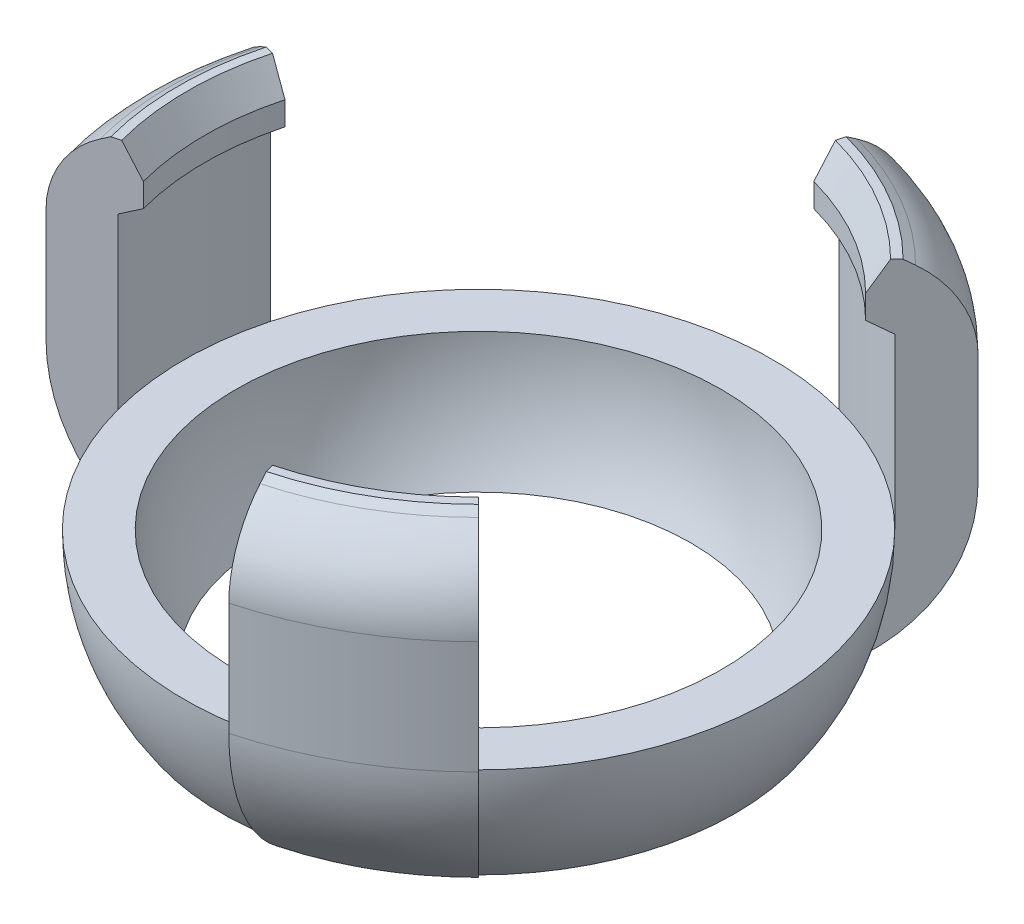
ISO-10303-21;
HEADER;
FILE_DESCRIPTION(('STEP AP214'),'2;1');
FILE_NAME('part.step','',(''),(''),'','','');
FILE_SCHEMA(('AUTOMOTIVE_DESIGN { 1 0 10303 214 1 1 1 1 }'));
ENDSEC;
DATA;
#1=APPLICATION_CONTEXT('core data for automotive mechanical design processes');
#2=APPLICATION_PROTOCOL_DEFINITION('international standard','automotive_design',2000,#1);
#3=PRODUCT_CONTEXT('',#1,'mechanical');
#4=PRODUCT('Part','Part','',(#3));
#5=PRODUCT_RELATED_PRODUCT_CATEGORY('part','',(#4));
#6=PRODUCT_DEFINITION_FORMATION('','',#4);
#7=PRODUCT_DEFINITION_CONTEXT('part definition',#1,'design');
#8=PRODUCT_DEFINITION('design','',#6,#7);
#9=PRODUCT_DEFINITION_SHAPE('','',#8);
#10=(LENGTH_UNIT() NAMED_UNIT(*) SI_UNIT(.MILLI.,.METRE.));
#11=(NAMED_UNIT(*) PLANE_ANGLE_UNIT() SI_UNIT($,.RADIAN.));
#12=(NAMED_UNIT(*) SI_UNIT($,.STERADIAN.) SOLID_ANGLE_UNIT());
#13=UNCERTAINTY_MEASURE_WITH_UNIT(LENGTH_MEASURE(1.E-05),#10,'distance_accuracy_value','');
#14=(GEOMETRIC_REPRESENTATION_CONTEXT(3) GLOBAL_UNCERTAINTY_ASSIGNED_CONTEXT((#13)) GLOBAL_UNIT_ASSIGNED_CONTEXT((#10,
#11,#12)) REPRESENTATION_CONTEXT('',''));
#15=CARTESIAN_POINT('',(0.,0.,0.));
#16=DIRECTION('',(0.,0.,1.));
#17=DIRECTION('',(1.,0.,0.));
#18=AXIS2_PLACEMENT_3D('',#15,#16,#17);
#19=CARTESIAN_POINT('',(0.,0.,0.));
#20=DIRECTION('',(0.,-1.,0.));
#21=DIRECTION('',(0.,0.,-1.));
#22=AXIS2_PLACEMENT_3D('',#19,#20,#21);
#23=CYLINDRICAL_SURFACE('',#22,10.);
#24=CARTESIAN_POINT('',(0.,5.75,0.));
#25=DIRECTION('',(0.,-1.,0.));
#26=DIRECTION('',(0.,0.,-1.));
#27=AXIS2_PLACEMENT_3D('',#24,#25,#26);
#28=CIRCLE('',#27,10.);
#29=CARTESIAN_POINT('',(2.58819045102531,5.75,-9.65925826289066));
#30=VERTEX_POINT('',#29);
#31=CARTESIAN_POINT('',(7.07106781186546,5.75,-7.07106781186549));
#32=VERTEX_POINT('',#31);
#33=EDGE_CURVE('E262',#30,#32,#28,.T.);
#34=ORIENTED_EDGE('',*,*,#33,.F.);
#35=DIRECTION('',(0.,-1.,0.));
#36=VECTOR('',#35,1.);
#37=CARTESIAN_POINT('',(2.58819045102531,0.,-9.65925826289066));
#38=LINE('',#37,#36);
#39=CARTESIAN_POINT('',(2.58819045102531,0.,-9.65925826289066));
#40=VERTEX_POINT('',#39);
#41=EDGE_CURVE('E250',#30,#40,#38,.T.);
#42=ORIENTED_EDGE('',*,*,#41,.T.);
#43=CARTESIAN_POINT('',(0.,0.,0.));
#44=DIRECTION('',(0.,-1.,0.));
#45=DIRECTION('',(0.,0.,-1.));
#46=AXIS2_PLACEMENT_3D('',#43,#44,#45);
#47=CIRCLE('',#46,10.);
#48=CARTESIAN_POINT('',(7.07106781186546,0.,-7.07106781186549));
#49=VERTEX_POINT('',#48);
#50=EDGE_CURVE('E260',#40,#49,#47,.T.);
#51=ORIENTED_EDGE('',*,*,#50,.T.);
#52=DIRECTION('',(0.,-1.,0.));
#53=VECTOR('',#52,1.);
#54=CARTESIAN_POINT('',(7.07106781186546,0.,-7.07106781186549));
#55=LINE('',#54,#53);
#56=EDGE_CURVE('E442',#32,#49,#55,.T.);
#57=ORIENTED_EDGE('',*,*,#56,.F.);
#58=EDGE_LOOP('',(#34,#42,#51,#57));
#59=FACE_BOUND('',#58,.T.);
#60=ADVANCED_FACE('F39',(#59),#23,.F.);
#61=CARTESIAN_POINT('',(0.,6.15414518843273,0.));
#62=DIRECTION('',(0.,-1.,0.));
#63=DIRECTION('',(0.,0.,-1.));
#64=AXIS2_PLACEMENT_3D('',#61,#62,#63);
#65=CONICAL_SURFACE('',#64,9.3,1.0471975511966);
#66=CARTESIAN_POINT('',(0.,6.15414518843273,0.));
#67=DIRECTION('',(0.,-1.,0.));
#68=DIRECTION('',(0.,0.,-1.));
#69=AXIS2_PLACEMENT_3D('',#66,#67,#68);
#70=CIRCLE('',#69,9.3);
#71=CARTESIAN_POINT('',(2.40701711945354,6.15414518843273,-8.98311018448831));
#72=VERTEX_POINT('',#71);
#73=CARTESIAN_POINT('',(6.57609306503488,6.15414518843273,-6.5760930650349));
#74=VERTEX_POINT('',#73);
#75=EDGE_CURVE('E490',#72,#74,#70,.T.);
#76=ORIENTED_EDGE('',*,*,#75,.F.);
#77=DIRECTION('',(0.224143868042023,-0.499999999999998,-0.836516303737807));
#78=VECTOR('',#77,1.);
#79=CARTESIAN_POINT('',(0.,11.5235026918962,0.));
#80=LINE('',#79,#78);
#81=EDGE_CURVE('E265',#72,#30,#80,.T.);
#82=ORIENTED_EDGE('',*,*,#81,.T.);
#83=ORIENTED_EDGE('',*,*,#33,.T.);
#84=DIRECTION('',(0.612372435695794,-0.499999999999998,-0.612372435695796));
#85=VECTOR('',#84,1.);
#86=CARTESIAN_POINT('',(0.,11.5235026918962,0.));
#87=LINE('',#86,#85);
#88=EDGE_CURVE('E438',#74,#32,#87,.T.);
#89=ORIENTED_EDGE('',*,*,#88,.F.);
#90=EDGE_LOOP('',(#76,#82,#83,#89));
#91=FACE_BOUND('',#90,.T.);
#92=ADVANCED_FACE('F515',(#91),#65,.F.);
#93=CARTESIAN_POINT('',(0.,0.,0.));
#94=DIRECTION('',(0.,-1.,0.));
#95=DIRECTION('',(0.,0.,-1.));
#96=AXIS2_PLACEMENT_3D('',#93,#94,#95);
#97=CYLINDRICAL_SURFACE('',#96,9.3);
#98=CARTESIAN_POINT('',(0.,6.95414518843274,0.));
#99=DIRECTION('',(0.,-1.,0.));
#100=DIRECTION('',(0.,0.,-1.));
#101=AXIS2_PLACEMENT_3D('',#98,#99,#100);
#102=CIRCLE('',#101,9.3);
#103=CARTESIAN_POINT('',(2.40701711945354,6.95414518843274,-8.98311018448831));
#104=VERTEX_POINT('',#103);
#105=CARTESIAN_POINT('',(6.57609306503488,6.95414518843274,-6.5760930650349));
#106=VERTEX_POINT('',#105);
#107=EDGE_CURVE('E484',#104,#106,#102,.T.);
#108=ORIENTED_EDGE('',*,*,#107,.F.);
#109=DIRECTION('',(0.,-1.,0.));
#110=VECTOR('',#109,1.);
#111=CARTESIAN_POINT('',(2.40701711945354,0.,-8.98311018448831));
#112=LINE('',#111,#110);
#113=EDGE_CURVE('E509',#104,#72,#112,.T.);
#114=ORIENTED_EDGE('',*,*,#113,.T.);
#115=ORIENTED_EDGE('',*,*,#75,.T.);
#116=DIRECTION('',(0.,-1.,0.));
#117=VECTOR('',#116,1.);
#118=CARTESIAN_POINT('',(6.57609306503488,0.,-6.5760930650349));
#119=LINE('',#118,#117);
#120=EDGE_CURVE('E434',#106,#74,#119,.T.);
#121=ORIENTED_EDGE('',*,*,#120,.F.);
#122=EDGE_LOOP('',(#108,#114,#115,#121));
#123=FACE_BOUND('',#122,.T.);
#124=ADVANCED_FACE('F508',(#123),#97,.F.);
#125=CARTESIAN_POINT('',(0.,7.95414518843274,0.));
#126=DIRECTION('',(0.,1.,0.));
#127=DIRECTION('',(0.,0.,1.));
#128=AXIS2_PLACEMENT_3D('',#125,#126,#127);
#129=CONICAL_SURFACE('',#128,9.9,0.540419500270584);
#130=CARTESIAN_POINT('',(0.,7.95414518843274,0.));
#131=DIRECTION('',(0.,-1.,0.));
#132=DIRECTION('',(0.,0.,-1.));
#133=AXIS2_PLACEMENT_3D('',#130,#131,#132);
#134=CIRCLE('',#133,9.9);
#135=CARTESIAN_POINT('',(2.56230854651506,7.95414518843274,-9.56266568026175));
#136=VERTEX_POINT('',#135);
#137=CARTESIAN_POINT('',(7.00035713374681,7.95414518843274,-7.00035713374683));
#138=VERTEX_POINT('',#137);
#139=EDGE_CURVE('E478',#136,#138,#134,.T.);
#140=ORIENTED_EDGE('',*,*,#139,.F.);
#141=DIRECTION('',(-0.133161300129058,-0.857492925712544,0.49696473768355));
#142=VECTOR('',#141,1.);
#143=CARTESIAN_POINT('',(0.,-8.54585481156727,0.));
#144=LINE('',#143,#142);
#145=EDGE_CURVE('E519',#136,#104,#144,.T.);
#146=ORIENTED_EDGE('',*,*,#145,.T.);
#147=ORIENTED_EDGE('',*,*,#107,.T.);
#148=DIRECTION('',(-0.363803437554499,-0.857492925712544,0.3638034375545));
#149=VECTOR('',#148,1.);
#150=CARTESIAN_POINT('',(0.,-8.54585481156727,0.));
#151=LINE('',#150,#149);
#152=EDGE_CURVE('E430',#138,#106,#151,.T.);
#153=ORIENTED_EDGE('',*,*,#152,.F.);
#154=EDGE_LOOP('',(#140,#146,#147,#153));
#155=FACE_BOUND('',#154,.T.);
#156=ADVANCED_FACE('F576',(#155),#129,.F.);
#157=CARTESIAN_POINT('',(9.9,7.95414518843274,0.));
#158=DIRECTION('',(0.,1.,0.));
#159=DIRECTION('',(0.,0.,1.));
#160=AXIS2_PLACEMENT_3D('',#157,#158,#159);
#161=PLANE('',#160);
#162=CARTESIAN_POINT('',(0.,7.95414518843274,0.));
#163=DIRECTION('',(0.,-1.,0.));
#164=DIRECTION('',(0.,0.,-1.));
#165=AXIS2_PLACEMENT_3D('',#162,#163,#164);
#166=CIRCLE('',#165,10.2);
#167=CARTESIAN_POINT('',(2.63995426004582,7.95414518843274,-9.85244342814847));
#168=VERTEX_POINT('',#167);
#169=CARTESIAN_POINT('',(7.21248916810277,7.95414518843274,-7.2124891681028));
#170=VERTEX_POINT('',#169);
#171=EDGE_CURVE('E472',#168,#170,#166,.T.);
#172=ORIENTED_EDGE('',*,*,#171,.F.);
#173=DIRECTION('',(-0.258819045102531,0.,0.965925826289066));
#174=VECTOR('',#173,1.);
#175=CARTESIAN_POINT('',(0.663174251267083,7.95414518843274,-2.47500000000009));
#176=LINE('',#175,#174);
#177=EDGE_CURVE('E579',#168,#136,#176,.T.);
#178=ORIENTED_EDGE('',*,*,#177,.T.);
#179=ORIENTED_EDGE('',*,*,#139,.T.);
#180=DIRECTION('',(-0.707106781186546,0.,0.707106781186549));
#181=VECTOR('',#180,1.);
#182=CARTESIAN_POINT('',(4.94999999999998,7.95414518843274,-4.95));
#183=LINE('',#182,#181);
#184=EDGE_CURVE('E426',#170,#138,#183,.T.);
#185=ORIENTED_EDGE('',*,*,#184,.F.);
#186=EDGE_LOOP('',(#172,#178,#179,#185));
#187=FACE_BOUND('',#186,.T.);
#188=ADVANCED_FACE('F697',(#187),#161,.T.);
#189=CARTESIAN_POINT('',(0.,7.78094010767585,0.));
#190=DIRECTION('',(0.,-1.,0.));
#191=DIRECTION('',(0.,0.,-1.));
#192=AXIS2_PLACEMENT_3D('',#189,#190,#191);
#193=CONICAL_SURFACE('',#192,10.5,1.04719755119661);
#194=CARTESIAN_POINT('',(0.,7.78094010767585,0.));
#195=DIRECTION('',(0.,-1.,0.));
#196=DIRECTION('',(0.,0.,-1.));
#197=AXIS2_PLACEMENT_3D('',#194,#195,#196);
#198=CIRCLE('',#197,10.5);
#199=CARTESIAN_POINT('',(2.71759997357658,7.78094010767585,-10.1422211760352));
#200=VERTEX_POINT('',#199);
#201=CARTESIAN_POINT('',(7.42462120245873,7.78094010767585,-7.42462120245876));
#202=VERTEX_POINT('',#201);
#203=EDGE_CURVE('E466',#200,#202,#198,.T.);
#204=ORIENTED_EDGE('',*,*,#203,.F.);
#205=DIRECTION('',(0.224143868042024,-0.499999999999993,-0.83651630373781));
#206=VECTOR('',#205,1.);
#207=CARTESIAN_POINT('',(0.,13.8431179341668,0.));
#208=LINE('',#207,#206);
#209=EDGE_CURVE('E581',#200,#168,#208,.F.);
#210=ORIENTED_EDGE('',*,*,#209,.T.);
#211=ORIENTED_EDGE('',*,*,#171,.T.);
#212=DIRECTION('',(0.612372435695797,-0.499999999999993,-0.612372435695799));
#213=VECTOR('',#212,1.);
#214=CARTESIAN_POINT('',(0.,13.8431179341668,0.));
#215=LINE('',#214,#213);
#216=EDGE_CURVE('E422',#202,#170,#215,.F.);
#217=ORIENTED_EDGE('',*,*,#216,.F.);
#218=EDGE_LOOP('',(#204,#210,#211,#217));
#219=FACE_BOUND('',#218,.T.);
#220=ADVANCED_FACE('F681',(#219),#193,.T.);
#221=CARTESIAN_POINT('',(0.,5.18286389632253,0.));
#222=DIRECTION('',(0.,-1.,0.));
#223=DIRECTION('',(0.,0.,-1.));
#224=AXIS2_PLACEMENT_3D('',#221,#222,#223);
#225=TOROIDAL_SURFACE('',#224,9.,3.);
#226=CARTESIAN_POINT('',(0.,5.18286389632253,0.));
#227=DIRECTION('',(0.,-1.,0.));
#228=DIRECTION('',(0.,0.,-1.));
#229=AXIS2_PLACEMENT_3D('',#226,#227,#228);
#230=CIRCLE('',#229,12.);
#231=CARTESIAN_POINT('',(3.10582854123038,5.18286389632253,-11.5911099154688));
#232=VERTEX_POINT('',#231);
#233=CARTESIAN_POINT('',(8.48528137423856,5.18286389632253,-8.48528137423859));
#234=VERTEX_POINT('',#233);
#235=EDGE_CURVE('E460',#232,#234,#230,.T.);
#236=ORIENTED_EDGE('',*,*,#235,.F.);
#237=CARTESIAN_POINT('',(2.32937140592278,5.18286389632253,-8.69333243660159));
#238=DIRECTION('',(-0.965925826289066,0.,-0.258819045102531));
#239=DIRECTION('',(-0.258819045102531,0.,0.965925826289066));
#240=AXIS2_PLACEMENT_3D('',#237,#238,#239);
#241=CIRCLE('',#240,3.);
#242=EDGE_CURVE('E587',#232,#200,#241,.F.);
#243=ORIENTED_EDGE('',*,*,#242,.T.);
#244=ORIENTED_EDGE('',*,*,#203,.T.);
#245=CARTESIAN_POINT('',(6.36396103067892,5.18286389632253,-6.36396103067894));
#246=DIRECTION('',(-0.707106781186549,0.,-0.707106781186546));
#247=DIRECTION('',(-0.707106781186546,0.,0.707106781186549));
#248=AXIS2_PLACEMENT_3D('',#245,#246,#247);
#249=CIRCLE('',#248,3.);
#250=EDGE_CURVE('E418',#234,#202,#249,.F.);
#251=ORIENTED_EDGE('',*,*,#250,.F.);
#252=EDGE_LOOP('',(#236,#243,#244,#251));
#253=FACE_BOUND('',#252,.T.);
#254=ADVANCED_FACE('F677',(#253),#225,.T.);
#255=CARTESIAN_POINT('',(0.,0.,0.));
#256=DIRECTION('',(0.,-1.,0.));
#257=DIRECTION('',(0.,0.,-1.));
#258=AXIS2_PLACEMENT_3D('',#255,#256,#257);
#259=CYLINDRICAL_SURFACE('',#258,12.);
#260=CARTESIAN_POINT('',(0.,1.35036574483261,0.));
#261=DIRECTION('',(0.,-1.,0.));
#262=DIRECTION('',(0.,0.,-1.));
#263=AXIS2_PLACEMENT_3D('',#260,#261,#262);
#264=CIRCLE('',#263,12.);
#265=CARTESIAN_POINT('',(3.10582854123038,1.35036574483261,-11.5911099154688));
#266=VERTEX_POINT('',#265);
#267=CARTESIAN_POINT('',(8.48528137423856,1.35036574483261,-8.48528137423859));
#268=VERTEX_POINT('',#267);
#269=EDGE_CURVE('E454',#266,#268,#264,.T.);
#270=ORIENTED_EDGE('',*,*,#269,.F.);
#271=DIRECTION('',(0.,-1.,0.));
#272=VECTOR('',#271,1.);
#273=CARTESIAN_POINT('',(3.10582854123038,0.,-11.5911099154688));
#274=LINE('',#273,#272);
#275=EDGE_CURVE('E591',#266,#232,#274,.F.);
#276=ORIENTED_EDGE('',*,*,#275,.T.);
#277=ORIENTED_EDGE('',*,*,#235,.T.);
#278=DIRECTION('',(0.,-1.,0.));
#279=VECTOR('',#278,1.);
#280=CARTESIAN_POINT('',(8.48528137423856,0.,-8.48528137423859));
#281=LINE('',#280,#279);
#282=EDGE_CURVE('E414',#268,#234,#281,.F.);
#283=ORIENTED_EDGE('',*,*,#282,.F.);
#284=EDGE_LOOP('',(#270,#276,#277,#283));
#285=FACE_BOUND('',#284,.T.);
#286=ADVANCED_FACE('F698',(#285),#259,.T.);
#287=CARTESIAN_POINT('',(0.,1.35036574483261,0.));
#288=DIRECTION('',(0.,-1.,0.));
#289=DIRECTION('',(0.,0.,-1.));
#290=AXIS2_PLACEMENT_3D('',#287,#288,#289);
#291=TOROIDAL_SURFACE('',#290,6.,6.);
#292=CARTESIAN_POINT('',(0.,-4.,0.));
#293=DIRECTION('',(0.,-1.,0.));
#294=DIRECTION('',(0.,0.,-1.));
#295=AXIS2_PLACEMENT_3D('',#292,#293,#294);
#296=CIRCLE('',#295,8.71543484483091);
#297=CARTESIAN_POINT('',(2.25572052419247,-4.,-8.41846360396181));
#298=VERTEX_POINT('',#297);
#299=CARTESIAN_POINT('',(6.16274307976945,-4.,-6.16274307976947));
#300=VERTEX_POINT('',#299);
#301=EDGE_CURVE('E449',#298,#300,#296,.T.);
#302=ORIENTED_EDGE('',*,*,#301,.F.);
#303=CARTESIAN_POINT('',(1.55291427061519,1.35036574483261,-5.7955549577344));
#304=DIRECTION('',(-0.965925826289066,0.,-0.258819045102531));
#305=DIRECTION('',(-0.258819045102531,0.,0.965925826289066));
#306=AXIS2_PLACEMENT_3D('',#303,#304,#305);
#307=CIRCLE('',#306,6.);
#308=EDGE_CURVE('E253',#298,#266,#307,.F.);
#309=ORIENTED_EDGE('',*,*,#308,.T.);
#310=ORIENTED_EDGE('',*,*,#269,.T.);
#311=CARTESIAN_POINT('',(4.24264068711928,1.35036574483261,-4.2426406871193));
#312=DIRECTION('',(-0.707106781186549,0.,-0.707106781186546));
#313=DIRECTION('',(-0.707106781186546,0.,0.707106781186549));
#314=AXIS2_PLACEMENT_3D('',#311,#312,#313);
#315=CIRCLE('',#314,6.);
#316=EDGE_CURVE('E410',#300,#268,#315,.F.);
#317=ORIENTED_EDGE('',*,*,#316,.F.);
#318=EDGE_LOOP('',(#302,#309,#310,#317));
#319=FACE_BOUND('',#318,.T.);
#320=ADVANCED_FACE('F651',(#319),#291,.T.);
#321=DIRECTION('',(0.,-1.,0.));
#322=VECTOR('',#321,1.);
#323=CARTESIAN_POINT('',(-9.65925826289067,0.,-2.58819045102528));
#324=LINE('',#323,#322);
#325=CARTESIAN_POINT('',(-9.65925826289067,5.75,-2.58819045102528));
#326=VERTEX_POINT('',#325);
#327=CARTESIAN_POINT('',(-9.65925826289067,0.,-2.58819045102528));
#328=VERTEX_POINT('',#327);
#329=EDGE_CURVE('E546',#326,#328,#324,.T.);
#330=ORIENTED_EDGE('',*,*,#329,.F.);
#331=CARTESIAN_POINT('',(-9.6592582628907,5.75,2.58819045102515));
#332=VERTEX_POINT('',#331);
#333=EDGE_CURVE('E277',#332,#326,#28,.T.);
#334=ORIENTED_EDGE('',*,*,#333,.F.);
#335=DIRECTION('',(0.,-1.,0.));
#336=VECTOR('',#335,1.);
#337=CARTESIAN_POINT('',(-9.6592582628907,0.,2.58819045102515));
#338=LINE('',#337,#336);
#339=CARTESIAN_POINT('',(-9.6592582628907,0.,2.58819045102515));
#340=VERTEX_POINT('',#339);
#341=EDGE_CURVE('E339',#332,#340,#338,.T.);
#342=ORIENTED_EDGE('',*,*,#341,.T.);
#343=EDGE_CURVE('E271',#340,#328,#47,.T.);
#344=ORIENTED_EDGE('',*,*,#343,.T.);
#345=EDGE_LOOP('',(#330,#334,#342,#344));
#346=FACE_BOUND('',#345,.T.);
#347=ADVANCED_FACE('F557',(#346),#23,.F.);
#348=DIRECTION('',(-0.836516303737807,-0.499999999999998,-0.22414386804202));
#349=VECTOR('',#348,1.);
#350=CARTESIAN_POINT('',(0.,11.5235026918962,0.));
#351=LINE('',#350,#349);
#352=CARTESIAN_POINT('',(-8.98311018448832,6.15414518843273,-2.40701711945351));
#353=VERTEX_POINT('',#352);
#354=EDGE_CURVE('E543',#353,#326,#351,.T.);
#355=ORIENTED_EDGE('',*,*,#354,.F.);
#356=CARTESIAN_POINT('',(-8.98311018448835,6.15414518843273,2.40701711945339));
#357=VERTEX_POINT('',#356);
#358=EDGE_CURVE('E495',#357,#353,#70,.T.);
#359=ORIENTED_EDGE('',*,*,#358,.F.);
#360=DIRECTION('',(-0.836516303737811,-0.499999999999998,0.224143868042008));
#361=VECTOR('',#360,1.);
#362=CARTESIAN_POINT('',(0.,11.5235026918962,0.));
#363=LINE('',#362,#361);
#364=EDGE_CURVE('E335',#357,#332,#363,.T.);
#365=ORIENTED_EDGE('',*,*,#364,.T.);
#366=ORIENTED_EDGE('',*,*,#333,.T.);
#367=EDGE_LOOP('',(#355,#359,#365,#366));
#368=FACE_BOUND('',#367,.T.);
#369=ADVANCED_FACE('F559',(#368),#65,.F.);
#370=DIRECTION('',(0.,-1.,0.));
#371=VECTOR('',#370,1.);
#372=CARTESIAN_POINT('',(-8.98311018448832,0.,-2.40701711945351));
#373=LINE('',#372,#371);
#374=CARTESIAN_POINT('',(-8.98311018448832,6.95414518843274,-2.40701711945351));
#375=VERTEX_POINT('',#374);
#376=EDGE_CURVE('E540',#375,#353,#373,.T.);
#377=ORIENTED_EDGE('',*,*,#376,.F.);
#378=CARTESIAN_POINT('',(-8.98311018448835,6.95414518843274,2.40701711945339));
#379=VERTEX_POINT('',#378);
#380=EDGE_CURVE('E491',#379,#375,#102,.T.);
#381=ORIENTED_EDGE('',*,*,#380,.F.);
#382=DIRECTION('',(0.,-1.,0.));
#383=VECTOR('',#382,1.);
#384=CARTESIAN_POINT('',(-8.98311018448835,0.,2.40701711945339));
#385=LINE('',#384,#383);
#386=EDGE_CURVE('E331',#379,#357,#385,.T.);
#387=ORIENTED_EDGE('',*,*,#386,.T.);
#388=ORIENTED_EDGE('',*,*,#358,.T.);
#389=EDGE_LOOP('',(#377,#381,#387,#388));
#390=FACE_BOUND('',#389,.T.);
#391=ADVANCED_FACE('F567',(#390),#97,.F.);
#392=DIRECTION('',(0.496964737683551,-0.857492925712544,0.133161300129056));
#393=VECTOR('',#392,1.);
#394=CARTESIAN_POINT('',(0.,-8.54585481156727,0.));
#395=LINE('',#394,#393);
#396=CARTESIAN_POINT('',(-9.56266568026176,7.95414518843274,-2.56230854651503));
#397=VERTEX_POINT('',#396);
#398=EDGE_CURVE('E537',#397,#375,#395,.T.);
#399=ORIENTED_EDGE('',*,*,#398,.F.);
#400=CARTESIAN_POINT('',(-9.56266568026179,7.95414518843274,2.5623085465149));
#401=VERTEX_POINT('',#400);
#402=EDGE_CURVE('E485',#401,#397,#134,.T.);
#403=ORIENTED_EDGE('',*,*,#402,.F.);
#404=DIRECTION('',(0.496964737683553,-0.857492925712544,-0.133161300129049));
#405=VECTOR('',#404,1.);
#406=CARTESIAN_POINT('',(0.,-8.54585481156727,0.));
#407=LINE('',#406,#405);
#408=EDGE_CURVE('E327',#401,#379,#407,.T.);
#409=ORIENTED_EDGE('',*,*,#408,.T.);
#410=ORIENTED_EDGE('',*,*,#380,.T.);
#411=EDGE_LOOP('',(#399,#403,#409,#410));
#412=FACE_BOUND('',#411,.T.);
#413=ADVANCED_FACE('F694',(#412),#129,.F.);
#414=DIRECTION('',(0.965925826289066,0.,0.258819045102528));
#415=VECTOR('',#414,1.);
#416=CARTESIAN_POINT('',(9.23682574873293,7.95414518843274,2.47500000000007));
#417=LINE('',#416,#415);
#418=CARTESIAN_POINT('',(-9.85244342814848,7.95414518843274,-2.63995426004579));
#419=VERTEX_POINT('',#418);
#420=EDGE_CURVE('E534',#419,#397,#417,.T.);
#421=ORIENTED_EDGE('',*,*,#420,.F.);
#422=CARTESIAN_POINT('',(-9.85244342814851,7.95414518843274,2.63995426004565));
#423=VERTEX_POINT('',#422);
#424=EDGE_CURVE('E479',#423,#419,#166,.T.);
#425=ORIENTED_EDGE('',*,*,#424,.F.);
#426=DIRECTION('',(0.96592582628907,0.,-0.258819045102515));
#427=VECTOR('',#426,1.);
#428=CARTESIAN_POINT('',(9.236825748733,7.95414518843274,-2.47499999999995));
#429=LINE('',#428,#427);
#430=EDGE_CURVE('E323',#423,#401,#429,.T.);
#431=ORIENTED_EDGE('',*,*,#430,.T.);
#432=ORIENTED_EDGE('',*,*,#402,.T.);
#433=EDGE_LOOP('',(#421,#425,#431,#432));
#434=FACE_BOUND('',#433,.T.);
#435=ADVANCED_FACE('F691',(#434),#161,.T.);
#436=DIRECTION('',(-0.83651630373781,-0.499999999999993,-0.224143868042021));
#437=VECTOR('',#436,1.);
#438=CARTESIAN_POINT('',(0.,13.8431179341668,0.));
#439=LINE('',#438,#437);
#440=CARTESIAN_POINT('',(-10.1422211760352,7.78094010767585,-2.71759997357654));
#441=VERTEX_POINT('',#440);
#442=EDGE_CURVE('E531',#441,#419,#439,.F.);
#443=ORIENTED_EDGE('',*,*,#442,.F.);
#444=CARTESIAN_POINT('',(-10.1422211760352,7.78094010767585,2.7175999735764));
#445=VERTEX_POINT('',#444);
#446=EDGE_CURVE('E473',#445,#441,#198,.T.);
#447=ORIENTED_EDGE('',*,*,#446,.F.);
#448=DIRECTION('',(-0.836516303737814,-0.499999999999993,0.224143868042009));
#449=VECTOR('',#448,1.);
#450=CARTESIAN_POINT('',(0.,13.8431179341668,0.));
#451=LINE('',#450,#449);
#452=EDGE_CURVE('E319',#445,#423,#451,.F.);
#453=ORIENTED_EDGE('',*,*,#452,.T.);
#454=ORIENTED_EDGE('',*,*,#424,.T.);
#455=EDGE_LOOP('',(#443,#447,#453,#454));
#456=FACE_BOUND('',#455,.T.);
#457=ADVANCED_FACE('F688',(#456),#193,.T.);
#458=CARTESIAN_POINT('',(-8.6933324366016,5.18286389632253,-2.32937140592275));
#459=DIRECTION('',(-0.258819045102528,0.,0.965925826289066));
#460=DIRECTION('',(0.965925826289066,0.,0.258819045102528));
#461=AXIS2_PLACEMENT_3D('',#458,#459,#460);
#462=CIRCLE('',#461,3.);
#463=CARTESIAN_POINT('',(-11.5911099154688,5.18286389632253,-3.10582854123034));
#464=VERTEX_POINT('',#463);
#465=EDGE_CURVE('E528',#464,#441,#462,.F.);
#466=ORIENTED_EDGE('',*,*,#465,.F.);
#467=CARTESIAN_POINT('',(-11.5911099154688,5.18286389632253,3.10582854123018));
#468=VERTEX_POINT('',#467);
#469=EDGE_CURVE('E467',#468,#464,#230,.T.);
#470=ORIENTED_EDGE('',*,*,#469,.F.);
#471=CARTESIAN_POINT('',(-8.69333243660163,5.18286389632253,2.32937140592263));
#472=DIRECTION('',(0.258819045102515,0.,0.96592582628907));
#473=DIRECTION('',(0.96592582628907,0.,-0.258819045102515));
#474=AXIS2_PLACEMENT_3D('',#471,#472,#473);
#475=CIRCLE('',#474,3.);
#476=EDGE_CURVE('E315',#468,#445,#475,.F.);
#477=ORIENTED_EDGE('',*,*,#476,.T.);
#478=ORIENTED_EDGE('',*,*,#446,.T.);
#479=EDGE_LOOP('',(#466,#470,#477,#478));
#480=FACE_BOUND('',#479,.T.);
#481=ADVANCED_FACE('F668',(#480),#225,.T.);
#482=DIRECTION('',(0.,-1.,0.));
#483=VECTOR('',#482,1.);
#484=CARTESIAN_POINT('',(-11.5911099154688,0.,-3.10582854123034));
#485=LINE('',#484,#483);
#486=CARTESIAN_POINT('',(-11.5911099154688,1.35036574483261,-3.10582854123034));
#487=VERTEX_POINT('',#486);
#488=EDGE_CURVE('E525',#487,#464,#485,.F.);
#489=ORIENTED_EDGE('',*,*,#488,.F.);
#490=CARTESIAN_POINT('',(-11.5911099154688,1.35036574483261,3.10582854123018));
#491=VERTEX_POINT('',#490);
#492=EDGE_CURVE('E461',#491,#487,#264,.T.);
#493=ORIENTED_EDGE('',*,*,#492,.F.);
#494=DIRECTION('',(0.,-1.,0.));
#495=VECTOR('',#494,1.);
#496=CARTESIAN_POINT('',(-11.5911099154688,0.,3.10582854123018));
#497=LINE('',#496,#495);
#498=EDGE_CURVE('E311',#491,#468,#497,.F.);
#499=ORIENTED_EDGE('',*,*,#498,.T.);
#500=ORIENTED_EDGE('',*,*,#469,.T.);
#501=EDGE_LOOP('',(#489,#493,#499,#500));
#502=FACE_BOUND('',#501,.T.);
#503=ADVANCED_FACE('F661',(#502),#259,.T.);
#504=CARTESIAN_POINT('',(-5.7955549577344,1.35036574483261,-1.55291427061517));
#505=DIRECTION('',(-0.258819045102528,0.,0.965925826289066));
#506=DIRECTION('',(0.965925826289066,0.,0.258819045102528));
#507=AXIS2_PLACEMENT_3D('',#504,#505,#506);
#508=CIRCLE('',#507,6.);
#509=CARTESIAN_POINT('',(-8.41846360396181,-4.,-2.25572052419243));
#510=VERTEX_POINT('',#509);
#511=EDGE_CURVE('E264',#510,#487,#508,.F.);
#512=ORIENTED_EDGE('',*,*,#511,.F.);
#513=CARTESIAN_POINT('',(-8.41846360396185,-4.,2.25572052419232));
#514=VERTEX_POINT('',#513);
#515=EDGE_CURVE('E607',#514,#510,#296,.T.);
#516=ORIENTED_EDGE('',*,*,#515,.F.);
#517=CARTESIAN_POINT('',(-5.79555495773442,1.35036574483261,1.55291427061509));
#518=DIRECTION('',(0.258819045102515,0.,0.96592582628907));
#519=DIRECTION('',(0.96592582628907,0.,-0.258819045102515));
#520=AXIS2_PLACEMENT_3D('',#517,#518,#519);
#521=CIRCLE('',#520,6.);
#522=EDGE_CURVE('E302',#514,#491,#521,.F.);
#523=ORIENTED_EDGE('',*,*,#522,.T.);
#524=ORIENTED_EDGE('',*,*,#492,.T.);
#525=EDGE_LOOP('',(#512,#516,#523,#524));
#526=FACE_BOUND('',#525,.T.);
#527=ADVANCED_FACE('F658',(#526),#291,.T.);
#528=CARTESIAN_POINT('',(0.,0.,0.));
#529=DIRECTION('',(0.,-1.,0.));
#530=DIRECTION('',(1.,0.,0.));
#531=AXIS2_PLACEMENT_3D('',#528,#529,#530);
#532=SPHERICAL_SURFACE('',#531,8.25);
#533=CARTESIAN_POINT('',(0.,-4.,0.));
#534=DIRECTION('',(0.,-1.,0.));
#535=DIRECTION('',(0.,0.,-1.));
#536=AXIS2_PLACEMENT_3D('',#533,#534,#535);
#537=CIRCLE('',#536,7.21543484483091);
#538=CARTESIAN_POINT('',(0.,-4.,-7.21543484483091));
#539=VERTEX_POINT('',#538);
#540=EDGE_CURVE('E445',#539,#539,#537,.T.);
#541=ORIENTED_EDGE('',*,*,#540,.T.);
#542=EDGE_LOOP('',(#541));
#543=FACE_BOUND('',#542,.T.);
#544=CARTESIAN_POINT('',(0.,0.,0.));
#545=DIRECTION('',(0.,-1.,0.));
#546=DIRECTION('',(0.,0.,-1.));
#547=AXIS2_PLACEMENT_3D('',#544,#545,#546);
#548=CIRCLE('',#547,8.25);
#549=CARTESIAN_POINT('',(0.,0.,-8.25));
#550=VERTEX_POINT('',#549);
#551=EDGE_CURVE('E11',#550,#550,#548,.T.);
#552=ORIENTED_EDGE('',*,*,#551,.F.);
#553=EDGE_LOOP('',(#552));
#554=FACE_BOUND('',#553,.T.);
#555=ADVANCED_FACE('F41',(#543,#554),#532,.F.);
#556=CARTESIAN_POINT('',(8.25,0.,0.));
#557=DIRECTION('',(0.,1.,0.));
#558=DIRECTION('',(0.,0.,1.));
#559=AXIS2_PLACEMENT_3D('',#556,#557,#558);
#560=PLANE('',#559);
#561=ORIENTED_EDGE('',*,*,#551,.T.);
#562=EDGE_LOOP('',(#561));
#563=FACE_BOUND('',#562,.T.);
#564=CARTESIAN_POINT('',(0.,0.,0.));
#565=DIRECTION('',(0.,-1.,0.));
#566=DIRECTION('',(-0.866025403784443,0.,0.499999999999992));
#567=AXIS2_PLACEMENT_3D('',#564,#565,#566);
#568=CIRCLE('',#567,10.);
#569=EDGE_CURVE('E236',#328,#40,#568,.T.);
#570=ORIENTED_EDGE('',*,*,#569,.F.);
#571=ORIENTED_EDGE('',*,*,#343,.F.);
#572=CARTESIAN_POINT('',(0.,0.,0.));
#573=DIRECTION('',(0.,-1.,0.));
#574=DIRECTION('',(0.866025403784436,0.,0.500000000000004));
#575=AXIS2_PLACEMENT_3D('',#572,#573,#574);
#576=CIRCLE('',#575,10.);
#577=CARTESIAN_POINT('',(2.58819045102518,0.,9.6592582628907));
#578=VERTEX_POINT('',#577);
#579=EDGE_CURVE('E293',#578,#340,#576,.T.);
#580=ORIENTED_EDGE('',*,*,#579,.F.);
#581=CARTESIAN_POINT('',(7.07106781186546,0.,7.07106781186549));
#582=VERTEX_POINT('',#581);
#583=EDGE_CURVE('E275',#582,#578,#47,.T.);
#584=ORIENTED_EDGE('',*,*,#583,.F.);
#585=EDGE_CURVE('E48',#49,#582,#47,.T.);
#586=ORIENTED_EDGE('',*,*,#585,.F.);
#587=ORIENTED_EDGE('',*,*,#50,.F.);
#588=EDGE_LOOP('',(#570,#571,#580,#584,#586,#587));
#589=FACE_BOUND('',#588,.T.);
#590=ADVANCED_FACE('F268',(#563,#589),#560,.T.);
#591=DIRECTION('',(0.,-1.,0.));
#592=VECTOR('',#591,1.);
#593=CARTESIAN_POINT('',(2.58819045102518,0.,9.65925826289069));
#594=LINE('',#593,#592);
#595=CARTESIAN_POINT('',(2.58819045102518,5.75,9.65925826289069));
#596=VERTEX_POINT('',#595);
#597=EDGE_CURVE('E290',#596,#578,#594,.T.);
#598=ORIENTED_EDGE('',*,*,#597,.F.);
#599=CARTESIAN_POINT('',(7.07106781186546,5.75,7.07106781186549));
#600=VERTEX_POINT('',#599);
#601=EDGE_CURVE('E272',#600,#596,#28,.T.);
#602=ORIENTED_EDGE('',*,*,#601,.F.);
#603=DIRECTION('',(0.,-1.,0.));
#604=VECTOR('',#603,1.);
#605=CARTESIAN_POINT('',(7.07106781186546,0.,7.07106781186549));
#606=LINE('',#605,#604);
#607=EDGE_CURVE('E291',#600,#582,#606,.T.);
#608=ORIENTED_EDGE('',*,*,#607,.T.);
#609=ORIENTED_EDGE('',*,*,#583,.T.);
#610=EDGE_LOOP('',(#598,#602,#608,#609));
#611=FACE_BOUND('',#610,.T.);
#612=ADVANCED_FACE('F288',(#611),#23,.F.);
#613=DIRECTION('',(0.224143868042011,-0.499999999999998,0.83651630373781));
#614=VECTOR('',#613,1.);
#615=CARTESIAN_POINT('',(0.,11.5235026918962,0.));
#616=LINE('',#615,#614);
#617=CARTESIAN_POINT('',(2.40701711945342,6.15414518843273,8.98311018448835));
#618=VERTEX_POINT('',#617);
#619=EDGE_CURVE('E364',#618,#596,#616,.T.);
#620=ORIENTED_EDGE('',*,*,#619,.F.);
#621=CARTESIAN_POINT('',(6.57609306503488,6.15414518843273,6.5760930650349));
#622=VERTEX_POINT('',#621);
#623=EDGE_CURVE('E492',#622,#618,#70,.T.);
#624=ORIENTED_EDGE('',*,*,#623,.F.);
#625=DIRECTION('',(0.612372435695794,-0.499999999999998,0.612372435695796));
#626=VECTOR('',#625,1.);
#627=CARTESIAN_POINT('',(0.,11.5235026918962,0.));
#628=LINE('',#627,#626);
#629=EDGE_CURVE('E404',#622,#600,#628,.T.);
#630=ORIENTED_EDGE('',*,*,#629,.T.);
#631=ORIENTED_EDGE('',*,*,#601,.T.);
#632=EDGE_LOOP('',(#620,#624,#630,#631));
#633=FACE_BOUND('',#632,.T.);
#634=ADVANCED_FACE('F644',(#633),#65,.F.);
#635=DIRECTION('',(0.,-1.,0.));
#636=VECTOR('',#635,1.);
#637=CARTESIAN_POINT('',(2.40701711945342,0.,8.98311018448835));
#638=LINE('',#637,#636);
#639=CARTESIAN_POINT('',(2.40701711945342,6.95414518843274,8.98311018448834));
#640=VERTEX_POINT('',#639);
#641=EDGE_CURVE('E361',#640,#618,#638,.T.);
#642=ORIENTED_EDGE('',*,*,#641,.F.);
#643=CARTESIAN_POINT('',(6.57609306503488,6.95414518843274,6.5760930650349));
#644=VERTEX_POINT('',#643);
#645=EDGE_CURVE('E486',#644,#640,#102,.T.);
#646=ORIENTED_EDGE('',*,*,#645,.F.);
#647=DIRECTION('',(0.,-1.,0.));
#648=VECTOR('',#647,1.);
#649=CARTESIAN_POINT('',(6.57609306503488,0.,6.5760930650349));
#650=LINE('',#649,#648);
#651=EDGE_CURVE('E400',#644,#622,#650,.T.);
#652=ORIENTED_EDGE('',*,*,#651,.T.);
#653=ORIENTED_EDGE('',*,*,#623,.T.);
#654=EDGE_LOOP('',(#642,#646,#652,#653));
#655=FACE_BOUND('',#654,.T.);
#656=ADVANCED_FACE('F641',(#655),#97,.F.);
#657=DIRECTION('',(-0.133161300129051,-0.857492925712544,-0.496964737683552));
#658=VECTOR('',#657,1.);
#659=CARTESIAN_POINT('',(0.,-8.54585481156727,0.));
#660=LINE('',#659,#658);
#661=CARTESIAN_POINT('',(2.56230854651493,7.95414518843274,9.56266568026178));
#662=VERTEX_POINT('',#661);
#663=EDGE_CURVE('E358',#662,#640,#660,.T.);
#664=ORIENTED_EDGE('',*,*,#663,.F.);
#665=CARTESIAN_POINT('',(7.00035713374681,7.95414518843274,7.00035713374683));
#666=VERTEX_POINT('',#665);
#667=EDGE_CURVE('E480',#666,#662,#134,.T.);
#668=ORIENTED_EDGE('',*,*,#667,.F.);
#669=DIRECTION('',(-0.363803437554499,-0.857492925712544,-0.3638034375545));
#670=VECTOR('',#669,1.);
#671=CARTESIAN_POINT('',(0.,-8.54585481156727,0.));
#672=LINE('',#671,#670);
#673=EDGE_CURVE('E396',#666,#644,#672,.T.);
#674=ORIENTED_EDGE('',*,*,#673,.T.);
#675=ORIENTED_EDGE('',*,*,#645,.T.);
#676=EDGE_LOOP('',(#664,#668,#674,#675));
#677=FACE_BOUND('',#676,.T.);
#678=ADVANCED_FACE('F639',(#677),#129,.F.);
#679=DIRECTION('',(-0.258819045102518,0.,-0.965925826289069));
#680=VECTOR('',#679,1.);
#681=CARTESIAN_POINT('',(0.663174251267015,7.95414518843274,2.47499999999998));
#682=LINE('',#681,#680);
#683=CARTESIAN_POINT('',(2.63995426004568,7.95414518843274,9.8524434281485));
#684=VERTEX_POINT('',#683);
#685=EDGE_CURVE('E355',#684,#662,#682,.T.);
#686=ORIENTED_EDGE('',*,*,#685,.F.);
#687=CARTESIAN_POINT('',(7.21248916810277,7.95414518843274,7.2124891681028));
#688=VERTEX_POINT('',#687);
#689=EDGE_CURVE('E474',#688,#684,#166,.T.);
#690=ORIENTED_EDGE('',*,*,#689,.F.);
#691=DIRECTION('',(-0.707106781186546,0.,-0.707106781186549));
#692=VECTOR('',#691,1.);
#693=CARTESIAN_POINT('',(4.94999999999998,7.95414518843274,4.95));
#694=LINE('',#693,#692);
#695=EDGE_CURVE('E392',#688,#666,#694,.T.);
#696=ORIENTED_EDGE('',*,*,#695,.T.);
#697=ORIENTED_EDGE('',*,*,#667,.T.);
#698=EDGE_LOOP('',(#686,#690,#696,#697));
#699=FACE_BOUND('',#698,.T.);
#700=ADVANCED_FACE('F635',(#699),#161,.T.);
#701=DIRECTION('',(0.224143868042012,-0.499999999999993,0.836516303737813));
#702=VECTOR('',#701,1.);
#703=CARTESIAN_POINT('',(0.,13.8431179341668,0.));
#704=LINE('',#703,#702);
#705=CARTESIAN_POINT('',(2.71759997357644,7.78094010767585,10.1422211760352));
#706=VERTEX_POINT('',#705);
#707=EDGE_CURVE('E352',#706,#684,#704,.F.);
#708=ORIENTED_EDGE('',*,*,#707,.F.);
#709=CARTESIAN_POINT('',(7.42462120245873,7.78094010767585,7.42462120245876));
#710=VERTEX_POINT('',#709);
#711=EDGE_CURVE('E468',#710,#706,#198,.T.);
#712=ORIENTED_EDGE('',*,*,#711,.F.);
#713=DIRECTION('',(0.612372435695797,-0.499999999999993,0.612372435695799));
#714=VECTOR('',#713,1.);
#715=CARTESIAN_POINT('',(0.,13.8431179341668,0.));
#716=LINE('',#715,#714);
#717=EDGE_CURVE('E388',#710,#688,#716,.F.);
#718=ORIENTED_EDGE('',*,*,#717,.T.);
#719=ORIENTED_EDGE('',*,*,#689,.T.);
#720=EDGE_LOOP('',(#708,#712,#718,#719));
#721=FACE_BOUND('',#720,.T.);
#722=ADVANCED_FACE('F632',(#721),#193,.T.);
#723=CARTESIAN_POINT('',(2.32937140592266,5.18286389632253,8.69333243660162));
#724=DIRECTION('',(0.965925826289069,0.,-0.258819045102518));
#725=DIRECTION('',(-0.258819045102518,0.,-0.965925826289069));
#726=AXIS2_PLACEMENT_3D('',#723,#724,#725);
#727=CIRCLE('',#726,3.);
#728=CARTESIAN_POINT('',(3.10582854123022,5.18286389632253,11.5911099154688));
#729=VERTEX_POINT('',#728);
#730=EDGE_CURVE('E349',#729,#706,#727,.F.);
#731=ORIENTED_EDGE('',*,*,#730,.F.);
#732=CARTESIAN_POINT('',(8.48528137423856,5.18286389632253,8.48528137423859));
#733=VERTEX_POINT('',#732);
#734=EDGE_CURVE('E462',#733,#729,#230,.T.);
#735=ORIENTED_EDGE('',*,*,#734,.F.);
#736=CARTESIAN_POINT('',(6.36396103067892,5.18286389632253,6.36396103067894));
#737=DIRECTION('',(0.707106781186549,0.,-0.707106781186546));
#738=DIRECTION('',(-0.707106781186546,0.,-0.707106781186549));
#739=AXIS2_PLACEMENT_3D('',#736,#737,#738);
#740=CIRCLE('',#739,3.);
#741=EDGE_CURVE('E384',#733,#710,#740,.F.);
#742=ORIENTED_EDGE('',*,*,#741,.T.);
#743=ORIENTED_EDGE('',*,*,#711,.T.);
#744=EDGE_LOOP('',(#731,#735,#742,#743));
#745=FACE_BOUND('',#744,.T.);
#746=ADVANCED_FACE('F627',(#745),#225,.T.);
#747=DIRECTION('',(0.,-1.,0.));
#748=VECTOR('',#747,1.);
#749=CARTESIAN_POINT('',(3.10582854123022,0.,11.5911099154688));
#750=LINE('',#749,#748);
#751=CARTESIAN_POINT('',(3.10582854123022,1.35036574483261,11.5911099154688));
#752=VERTEX_POINT('',#751);
#753=EDGE_CURVE('E346',#752,#729,#750,.F.);
#754=ORIENTED_EDGE('',*,*,#753,.F.);
#755=CARTESIAN_POINT('',(8.48528137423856,1.35036574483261,8.48528137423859));
#756=VERTEX_POINT('',#755);
#757=EDGE_CURVE('E456',#756,#752,#264,.T.);
#758=ORIENTED_EDGE('',*,*,#757,.F.);
#759=DIRECTION('',(0.,-1.,0.));
#760=VECTOR('',#759,1.);
#761=CARTESIAN_POINT('',(8.48528137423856,0.,8.48528137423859));
#762=LINE('',#761,#760);
#763=EDGE_CURVE('E380',#756,#733,#762,.F.);
#764=ORIENTED_EDGE('',*,*,#763,.T.);
#765=ORIENTED_EDGE('',*,*,#734,.T.);
#766=EDGE_LOOP('',(#754,#758,#764,#765));
#767=FACE_BOUND('',#766,.T.);
#768=ADVANCED_FACE('F624',(#767),#259,.T.);
#769=CARTESIAN_POINT('',(1.55291427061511,1.35036574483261,5.79555495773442));
#770=DIRECTION('',(0.965925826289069,0.,-0.258819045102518));
#771=DIRECTION('',(-0.258819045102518,0.,-0.965925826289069));
#772=AXIS2_PLACEMENT_3D('',#769,#770,#771);
#773=CIRCLE('',#772,6.);
#774=CARTESIAN_POINT('',(2.25572052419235,-4.,8.41846360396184));
#775=VERTEX_POINT('',#774);
#776=EDGE_CURVE('E343',#775,#752,#773,.F.);
#777=ORIENTED_EDGE('',*,*,#776,.F.);
#778=CARTESIAN_POINT('',(6.16274307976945,-4.,6.16274307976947));
#779=VERTEX_POINT('',#778);
#780=EDGE_CURVE('E455',#779,#775,#296,.T.);
#781=ORIENTED_EDGE('',*,*,#780,.F.);
#782=CARTESIAN_POINT('',(4.24264068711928,1.35036574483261,4.2426406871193));
#783=DIRECTION('',(0.707106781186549,0.,-0.707106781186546));
#784=DIRECTION('',(-0.707106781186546,0.,-0.707106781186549));
#785=AXIS2_PLACEMENT_3D('',#782,#783,#784);
#786=CIRCLE('',#785,6.);
#787=EDGE_CURVE('E376',#779,#756,#786,.F.);
#788=ORIENTED_EDGE('',*,*,#787,.T.);
#789=ORIENTED_EDGE('',*,*,#757,.T.);
#790=EDGE_LOOP('',(#777,#781,#788,#789));
#791=FACE_BOUND('',#790,.T.);
#792=ADVANCED_FACE('F616',(#791),#291,.T.);
#793=CARTESIAN_POINT('',(7.21543484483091,-4.,0.));
#794=DIRECTION('',(0.,-1.,0.));
#795=DIRECTION('',(0.,0.,-1.));
#796=AXIS2_PLACEMENT_3D('',#793,#794,#795);
#797=PLANE('',#796);
#798=EDGE_CURVE('E450',#300,#779,#296,.T.);
#799=ORIENTED_EDGE('',*,*,#798,.T.);
#800=ORIENTED_EDGE('',*,*,#780,.T.);
#801=CARTESIAN_POINT('',(0.,-4.,0.));
#802=DIRECTION('',(0.,-1.,0.));
#803=DIRECTION('',(0.866025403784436,0.,0.500000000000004));
#804=AXIS2_PLACEMENT_3D('',#801,#802,#803);
#805=CIRCLE('',#804,8.71543484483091);
#806=EDGE_CURVE('E296',#775,#514,#805,.T.);
#807=ORIENTED_EDGE('',*,*,#806,.T.);
#808=ORIENTED_EDGE('',*,*,#515,.T.);
#809=CARTESIAN_POINT('',(0.,-4.,0.));
#810=DIRECTION('',(0.,-1.,0.));
#811=DIRECTION('',(-0.866025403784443,0.,0.499999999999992));
#812=AXIS2_PLACEMENT_3D('',#809,#810,#811);
#813=CIRCLE('',#812,8.71543484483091);
#814=EDGE_CURVE('E245',#510,#298,#813,.T.);
#815=ORIENTED_EDGE('',*,*,#814,.T.);
#816=ORIENTED_EDGE('',*,*,#301,.T.);
#817=EDGE_LOOP('',(#799,#800,#807,#808,#815,#816));
#818=FACE_BOUND('',#817,.T.);
#819=ORIENTED_EDGE('',*,*,#540,.F.);
#820=EDGE_LOOP('',(#819));
#821=FACE_BOUND('',#820,.T.);
#822=ADVANCED_FACE('F603',(#818,#821),#797,.T.);
#823=CARTESIAN_POINT('',(0.,0.,0.));
#824=DIRECTION('',(0.,-1.,0.));
#825=DIRECTION('',(0.,0.,-1.));
#826=AXIS2_PLACEMENT_3D('',#823,#824,#825);
#827=DEGENERATE_TOROIDAL_SURFACE('',#826,3.12992900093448,6.87007099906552,.T.);
#828=CARTESIAN_POINT('',(2.21319402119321,0.,-2.21319402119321));
#829=DIRECTION('',(-0.707106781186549,0.,-0.707106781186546));
#830=DIRECTION('',(-0.707106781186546,0.,0.707106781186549));
#831=AXIS2_PLACEMENT_3D('',#828,#829,#830);
#832=CIRCLE('',#831,6.87007099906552);
#833=EDGE_CURVE('E372',#49,#300,#832,.T.);
#834=ORIENTED_EDGE('',*,*,#833,.F.);
#835=ORIENTED_EDGE('',*,*,#585,.T.);
#836=CARTESIAN_POINT('',(2.21319402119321,0.,2.21319402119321));
#837=DIRECTION('',(0.707106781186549,0.,-0.707106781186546));
#838=DIRECTION('',(-0.707106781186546,0.,-0.707106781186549));
#839=AXIS2_PLACEMENT_3D('',#836,#837,#838);
#840=CIRCLE('',#839,6.87007099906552);
#841=EDGE_CURVE('E369',#582,#779,#840,.T.);
#842=ORIENTED_EDGE('',*,*,#841,.T.);
#843=ORIENTED_EDGE('',*,*,#798,.F.);
#844=EDGE_LOOP('',(#834,#835,#842,#843));
#845=FACE_BOUND('',#844,.T.);
#846=ADVANCED_FACE('F647',(#845),#827,.T.);
#847=CARTESIAN_POINT('',(2.21319402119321,0.,-2.21319402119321));
#848=DIRECTION('',(-0.707106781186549,0.,-0.707106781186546));
#849=DIRECTION('',(-0.707106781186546,0.,0.707106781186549));
#850=AXIS2_PLACEMENT_3D('',#847,#848,#849);
#851=PLANE('',#850);
#852=ORIENTED_EDGE('',*,*,#56,.T.);
#853=ORIENTED_EDGE('',*,*,#833,.T.);
#854=ORIENTED_EDGE('',*,*,#316,.T.);
#855=ORIENTED_EDGE('',*,*,#282,.T.);
#856=ORIENTED_EDGE('',*,*,#250,.T.);
#857=ORIENTED_EDGE('',*,*,#216,.T.);
#858=ORIENTED_EDGE('',*,*,#184,.T.);
#859=ORIENTED_EDGE('',*,*,#152,.T.);
#860=ORIENTED_EDGE('',*,*,#120,.T.);
#861=ORIENTED_EDGE('',*,*,#88,.T.);
#862=EDGE_LOOP('',(#852,#853,#854,#855,#856,#857,#858,#859,#860,#861));
#863=FACE_BOUND('',#862,.T.);
#864=ADVANCED_FACE('F513',(#863),#851,.F.);
#865=CARTESIAN_POINT('',(2.21319402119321,0.,2.21319402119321));
#866=DIRECTION('',(0.707106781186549,0.,-0.707106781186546));
#867=DIRECTION('',(-0.707106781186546,0.,-0.707106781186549));
#868=AXIS2_PLACEMENT_3D('',#865,#866,#867);
#869=PLANE('',#868);
#870=ORIENTED_EDGE('',*,*,#629,.F.);
#871=ORIENTED_EDGE('',*,*,#651,.F.);
#872=ORIENTED_EDGE('',*,*,#673,.F.);
#873=ORIENTED_EDGE('',*,*,#695,.F.);
#874=ORIENTED_EDGE('',*,*,#717,.F.);
#875=ORIENTED_EDGE('',*,*,#741,.F.);
#876=ORIENTED_EDGE('',*,*,#763,.F.);
#877=ORIENTED_EDGE('',*,*,#787,.F.);
#878=ORIENTED_EDGE('',*,*,#841,.F.);
#879=ORIENTED_EDGE('',*,*,#607,.F.);
#880=EDGE_LOOP('',(#870,#871,#872,#873,#874,#875,#876,#877,#878,#879));
#881=FACE_BOUND('',#880,.T.);
#882=ADVANCED_FACE('F646',(#881),#869,.T.);
#883=CARTESIAN_POINT('',(0.,0.,0.));
#884=DIRECTION('',(0.,-1.,0.));
#885=DIRECTION('',(0.866025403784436,0.,0.500000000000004));
#886=AXIS2_PLACEMENT_3D('',#883,#884,#885);
#887=DEGENERATE_TOROIDAL_SURFACE('',#886,3.12992900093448,6.87007099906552,.T.);
#888=CARTESIAN_POINT('',(0.810085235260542,0.,3.02327925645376));
#889=DIRECTION('',(0.965925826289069,0.,-0.258819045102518));
#890=DIRECTION('',(-0.258819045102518,0.,-0.965925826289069));
#891=AXIS2_PLACEMENT_3D('',#888,#889,#890);
#892=CIRCLE('',#891,6.87007099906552);
#893=EDGE_CURVE('E297',#578,#775,#892,.T.);
#894=ORIENTED_EDGE('',*,*,#893,.F.);
#895=ORIENTED_EDGE('',*,*,#579,.T.);
#896=CARTESIAN_POINT('',(-3.02327925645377,0.,0.810085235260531));
#897=DIRECTION('',(0.258819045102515,0.,0.96592582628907));
#898=DIRECTION('',(0.96592582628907,0.,-0.258819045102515));
#899=AXIS2_PLACEMENT_3D('',#896,#897,#898);
#900=CIRCLE('',#899,6.87007099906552);
#901=EDGE_CURVE('E63',#340,#514,#900,.T.);
#902=ORIENTED_EDGE('',*,*,#901,.T.);
#903=ORIENTED_EDGE('',*,*,#806,.F.);
#904=EDGE_LOOP('',(#894,#895,#902,#903));
#905=FACE_BOUND('',#904,.T.);
#906=ADVANCED_FACE('F746',(#905),#887,.T.);
#907=CARTESIAN_POINT('',(0.810085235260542,0.,3.02327925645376));
#908=DIRECTION('',(0.965925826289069,0.,-0.258819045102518));
#909=DIRECTION('',(-0.258819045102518,0.,-0.965925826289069));
#910=AXIS2_PLACEMENT_3D('',#907,#908,#909);
#911=PLANE('',#910);
#912=ORIENTED_EDGE('',*,*,#597,.T.);
#913=ORIENTED_EDGE('',*,*,#893,.T.);
#914=ORIENTED_EDGE('',*,*,#776,.T.);
#915=ORIENTED_EDGE('',*,*,#753,.T.);
#916=ORIENTED_EDGE('',*,*,#730,.T.);
#917=ORIENTED_EDGE('',*,*,#707,.T.);
#918=ORIENTED_EDGE('',*,*,#685,.T.);
#919=ORIENTED_EDGE('',*,*,#663,.T.);
#920=ORIENTED_EDGE('',*,*,#641,.T.);
#921=ORIENTED_EDGE('',*,*,#619,.T.);
#922=EDGE_LOOP('',(#912,#913,#914,#915,#916,#917,#918,#919,#920,#921));
#923=FACE_BOUND('',#922,.T.);
#924=ADVANCED_FACE('F621',(#923),#911,.F.);
#925=CARTESIAN_POINT('',(-3.02327925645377,0.,0.810085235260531));
#926=DIRECTION('',(0.258819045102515,0.,0.96592582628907));
#927=DIRECTION('',(0.96592582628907,0.,-0.258819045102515));
#928=AXIS2_PLACEMENT_3D('',#925,#926,#927);
#929=PLANE('',#928);
#930=ORIENTED_EDGE('',*,*,#364,.F.);
#931=ORIENTED_EDGE('',*,*,#386,.F.);
#932=ORIENTED_EDGE('',*,*,#408,.F.);
#933=ORIENTED_EDGE('',*,*,#430,.F.);
#934=ORIENTED_EDGE('',*,*,#452,.F.);
#935=ORIENTED_EDGE('',*,*,#476,.F.);
#936=ORIENTED_EDGE('',*,*,#498,.F.);
#937=ORIENTED_EDGE('',*,*,#522,.F.);
#938=ORIENTED_EDGE('',*,*,#901,.F.);
#939=ORIENTED_EDGE('',*,*,#341,.F.);
#940=EDGE_LOOP('',(#930,#931,#932,#933,#934,#935,#936,#937,#938,#939));
#941=FACE_BOUND('',#940,.T.);
#942=ADVANCED_FACE('F563',(#941),#929,.T.);
#943=CARTESIAN_POINT('',(0.,0.,0.));
#944=DIRECTION('',(0.,-1.,0.));
#945=DIRECTION('',(-0.866025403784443,0.,0.499999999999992));
#946=AXIS2_PLACEMENT_3D('',#943,#944,#945);
#947=DEGENERATE_TOROIDAL_SURFACE('',#946,3.12992900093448,6.87007099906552,.T.);
#948=CARTESIAN_POINT('',(-3.02327925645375,0.,-0.810085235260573));
#949=DIRECTION('',(-0.258819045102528,0.,0.965925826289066));
#950=DIRECTION('',(0.965925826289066,0.,0.258819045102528));
#951=AXIS2_PLACEMENT_3D('',#948,#949,#950);
#952=CIRCLE('',#951,6.87007099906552);
#953=EDGE_CURVE('E239',#328,#510,#952,.T.);
#954=ORIENTED_EDGE('',*,*,#953,.F.);
#955=ORIENTED_EDGE('',*,*,#569,.T.);
#956=CARTESIAN_POINT('',(0.810085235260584,0.,-3.02327925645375));
#957=DIRECTION('',(-0.965925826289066,0.,-0.258819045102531));
#958=DIRECTION('',(-0.258819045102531,0.,0.965925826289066));
#959=AXIS2_PLACEMENT_3D('',#956,#957,#958);
#960=CIRCLE('',#959,6.87007099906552);
#961=EDGE_CURVE('E55',#40,#298,#960,.T.);
#962=ORIENTED_EDGE('',*,*,#961,.T.);
#963=ORIENTED_EDGE('',*,*,#814,.F.);
#964=EDGE_LOOP('',(#954,#955,#962,#963));
#965=FACE_BOUND('',#964,.T.);
#966=ADVANCED_FACE('F237',(#965),#947,.T.);
#967=CARTESIAN_POINT('',(-3.02327925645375,0.,-0.810085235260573));
#968=DIRECTION('',(-0.258819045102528,0.,0.965925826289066));
#969=DIRECTION('',(0.965925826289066,0.,0.258819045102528));
#970=AXIS2_PLACEMENT_3D('',#967,#968,#969);
#971=PLANE('',#970);
#972=ORIENTED_EDGE('',*,*,#329,.T.);
#973=ORIENTED_EDGE('',*,*,#953,.T.);
#974=ORIENTED_EDGE('',*,*,#511,.T.);
#975=ORIENTED_EDGE('',*,*,#488,.T.);
#976=ORIENTED_EDGE('',*,*,#465,.T.);
#977=ORIENTED_EDGE('',*,*,#442,.T.);
#978=ORIENTED_EDGE('',*,*,#420,.T.);
#979=ORIENTED_EDGE('',*,*,#398,.T.);
#980=ORIENTED_EDGE('',*,*,#376,.T.);
#981=ORIENTED_EDGE('',*,*,#354,.T.);
#982=EDGE_LOOP('',(#972,#973,#974,#975,#976,#977,#978,#979,#980,#981));
#983=FACE_BOUND('',#982,.T.);
#984=ADVANCED_FACE('F551',(#983),#971,.F.);
#985=CARTESIAN_POINT('',(0.810085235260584,0.,-3.02327925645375));
#986=DIRECTION('',(-0.965925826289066,0.,-0.258819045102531));
#987=DIRECTION('',(-0.258819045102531,0.,0.965925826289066));
#988=AXIS2_PLACEMENT_3D('',#985,#986,#987);
#989=PLANE('',#988);
#990=ORIENTED_EDGE('',*,*,#81,.F.);
#991=ORIENTED_EDGE('',*,*,#113,.F.);
#992=ORIENTED_EDGE('',*,*,#145,.F.);
#993=ORIENTED_EDGE('',*,*,#177,.F.);
#994=ORIENTED_EDGE('',*,*,#209,.F.);
#995=ORIENTED_EDGE('',*,*,#242,.F.);
#996=ORIENTED_EDGE('',*,*,#275,.F.);
#997=ORIENTED_EDGE('',*,*,#308,.F.);
#998=ORIENTED_EDGE('',*,*,#961,.F.);
#999=ORIENTED_EDGE('',*,*,#41,.F.);
#1000=EDGE_LOOP('',(#990,#991,#992,#993,#994,#995,#996,#997,#998,#999));
#1001=FACE_BOUND('',#1000,.T.);
#1002=ADVANCED_FACE('F249',(#1001),#989,.T.);
#1003=CLOSED_SHELL('',(#60,#92,#124,#156,#188,#220,#254,#286,#320,#347,#369,#391,#413,#435,#457,
#481,#503,#527,#555,#590,#612,#634,#656,#678,#700,#722,#746,#768,#792,#822,#846,#864,#882,#906,
#924,#942,#966,#984,#1002));
#1004=MANIFOLD_SOLID_BREP('B2',#1003);
#1005=ADVANCED_BREP_SHAPE_REPRESENTATION('',(#18,#1004),#14);
#1006=SHAPE_DEFINITION_REPRESENTATION(#9,#1005);
ENDSEC;
END-ISO-10303-21;
